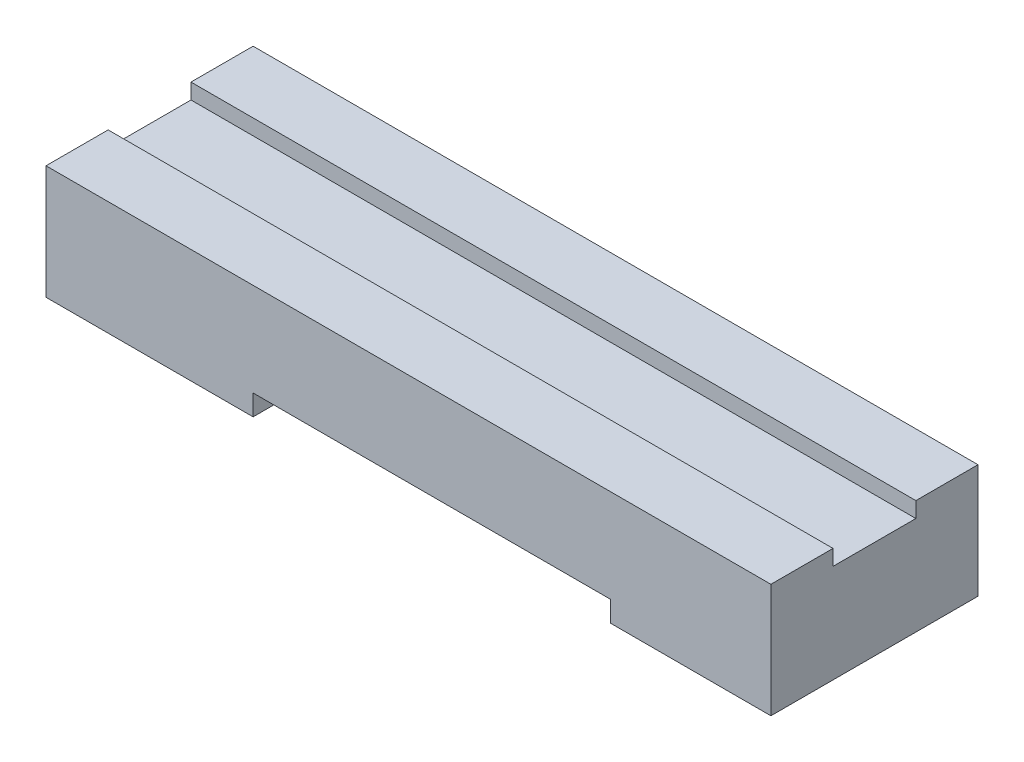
ISO-10303-21;
HEADER;
FILE_DESCRIPTION(('STEP AP214'),'2;1');
FILE_NAME('part.step','',(''),(''),'','','');
FILE_SCHEMA(('AUTOMOTIVE_DESIGN { 1 0 10303 214 1 1 1 1 }'));
ENDSEC;
DATA;
#1=APPLICATION_CONTEXT('core data for automotive mechanical design processes');
#2=APPLICATION_PROTOCOL_DEFINITION('international standard','automotive_design',2000,#1);
#3=PRODUCT_CONTEXT('',#1,'mechanical');
#4=PRODUCT('Part','Part','',(#3));
#5=PRODUCT_RELATED_PRODUCT_CATEGORY('part','',(#4));
#6=PRODUCT_DEFINITION_FORMATION('','',#4);
#7=PRODUCT_DEFINITION_CONTEXT('part definition',#1,'design');
#8=PRODUCT_DEFINITION('design','',#6,#7);
#9=PRODUCT_DEFINITION_SHAPE('','',#8);
#10=(LENGTH_UNIT() NAMED_UNIT(*) SI_UNIT(.MILLI.,.METRE.));
#11=(NAMED_UNIT(*) PLANE_ANGLE_UNIT() SI_UNIT($,.RADIAN.));
#12=(NAMED_UNIT(*) SI_UNIT($,.STERADIAN.) SOLID_ANGLE_UNIT());
#13=UNCERTAINTY_MEASURE_WITH_UNIT(LENGTH_MEASURE(1.E-05),#10,'distance_accuracy_value','');
#14=(GEOMETRIC_REPRESENTATION_CONTEXT(3) GLOBAL_UNCERTAINTY_ASSIGNED_CONTEXT((#13)) GLOBAL_UNIT_ASSIGNED_CONTEXT((#10,
#11,#12)) REPRESENTATION_CONTEXT('',''));
#15=CARTESIAN_POINT('',(0.,0.,0.));
#16=DIRECTION('',(0.,0.,1.));
#17=DIRECTION('',(1.,0.,0.));
#18=AXIS2_PLACEMENT_3D('',#15,#16,#17);
#19=CARTESIAN_POINT('',(-700.,110.,400.));
#20=DIRECTION('',(0.,-1.,0.));
#21=DIRECTION('',(0.,0.,-1.));
#22=AXIS2_PLACEMENT_3D('',#19,#20,#21);
#23=PLANE('',#22);
#24=DIRECTION('',(0.,0.,-1.));
#25=VECTOR('',#24,1.);
#26=CARTESIAN_POINT('',(-700.,110.,400.));
#27=LINE('',#26,#25);
#28=CARTESIAN_POINT('',(-700.,110.,120.));
#29=VERTEX_POINT('',#28);
#30=CARTESIAN_POINT('',(-700.,110.,0.));
#31=VERTEX_POINT('',#30);
#32=EDGE_CURVE('E199',#29,#31,#27,.T.);
#33=ORIENTED_EDGE('',*,*,#32,.F.);
#34=DIRECTION('',(-1.,0.,0.));
#35=VECTOR('',#34,1.);
#36=CARTESIAN_POINT('',(700.,110.,120.));
#37=LINE('',#36,#35);
#38=CARTESIAN_POINT('',(700.,110.,120.));
#39=VERTEX_POINT('',#38);
#40=EDGE_CURVE('E134',#39,#29,#37,.T.);
#41=ORIENTED_EDGE('',*,*,#40,.F.);
#42=DIRECTION('',(0.,0.,-1.));
#43=VECTOR('',#42,1.);
#44=CARTESIAN_POINT('',(700.,110.,400.));
#45=LINE('',#44,#43);
#46=CARTESIAN_POINT('',(700.,110.,0.));
#47=VERTEX_POINT('',#46);
#48=EDGE_CURVE('E202',#39,#47,#45,.T.);
#49=ORIENTED_EDGE('',*,*,#48,.T.);
#50=DIRECTION('',(-1.,0.,0.));
#51=VECTOR('',#50,1.);
#52=CARTESIAN_POINT('',(-700.,110.,0.));
#53=LINE('',#52,#51);
#54=EDGE_CURVE('E185',#47,#31,#53,.T.);
#55=ORIENTED_EDGE('',*,*,#54,.T.);
#56=EDGE_LOOP('',(#33,#41,#49,#55));
#57=FACE_BOUND('',#56,.T.);
#58=ADVANCED_FACE('F29',(#57),#23,.F.);
#59=CARTESIAN_POINT('',(-700.,-110.,400.));
#60=DIRECTION('',(0.,1.,0.));
#61=DIRECTION('',(-1.,0.,0.));
#62=AXIS2_PLACEMENT_3D('',#59,#60,#61);
#63=PLANE('',#62);
#64=DIRECTION('',(1.,0.,0.));
#65=VECTOR('',#64,1.);
#66=CARTESIAN_POINT('',(-700.,-110.,0.));
#67=LINE('',#66,#65);
#68=CARTESIAN_POINT('',(-700.,-110.,0.));
#69=VERTEX_POINT('',#68);
#70=CARTESIAN_POINT('',(-300.,-110.,0.));
#71=VERTEX_POINT('',#70);
#72=EDGE_CURVE('E179',#69,#71,#67,.T.);
#73=ORIENTED_EDGE('',*,*,#72,.T.);
#74=DIRECTION('',(0.,0.,1.));
#75=VECTOR('',#74,1.);
#76=CARTESIAN_POINT('',(-300.,-110.,0.));
#77=LINE('',#76,#75);
#78=CARTESIAN_POINT('',(-300.,-110.,400.));
#79=VERTEX_POINT('',#78);
#80=EDGE_CURVE('E166',#71,#79,#77,.T.);
#81=ORIENTED_EDGE('',*,*,#80,.T.);
#82=DIRECTION('',(1.,0.,0.));
#83=VECTOR('',#82,1.);
#84=CARTESIAN_POINT('',(-700.,-110.,400.));
#85=LINE('',#84,#83);
#86=CARTESIAN_POINT('',(-700.,-110.,400.));
#87=VERTEX_POINT('',#86);
#88=EDGE_CURVE('E192',#87,#79,#85,.T.);
#89=ORIENTED_EDGE('',*,*,#88,.F.);
#90=DIRECTION('',(0.,0.,-1.));
#91=VECTOR('',#90,1.);
#92=CARTESIAN_POINT('',(-700.,-110.,400.));
#93=LINE('',#92,#91);
#94=EDGE_CURVE('E11',#87,#69,#93,.T.);
#95=ORIENTED_EDGE('',*,*,#94,.T.);
#96=EDGE_LOOP('',(#73,#81,#89,#95));
#97=FACE_BOUND('',#96,.T.);
#98=ADVANCED_FACE('F240',(#97),#63,.F.);
#99=CARTESIAN_POINT('',(-700.,110.,400.));
#100=DIRECTION('',(1.,0.,0.));
#101=DIRECTION('',(0.,0.,-1.));
#102=AXIS2_PLACEMENT_3D('',#99,#100,#101);
#103=PLANE('',#102);
#104=DIRECTION('',(0.,0.,1.));
#105=VECTOR('',#104,1.);
#106=CARTESIAN_POINT('',(-700.,80.,120.));
#107=LINE('',#106,#105);
#108=CARTESIAN_POINT('',(-700.,80.,120.));
#109=VERTEX_POINT('',#108);
#110=CARTESIAN_POINT('',(-700.,80.,280.));
#111=VERTEX_POINT('',#110);
#112=EDGE_CURVE('E122',#109,#111,#107,.T.);
#113=ORIENTED_EDGE('',*,*,#112,.F.);
#114=DIRECTION('',(0.,-1.,0.));
#115=VECTOR('',#114,1.);
#116=CARTESIAN_POINT('',(-700.,110.,120.));
#117=LINE('',#116,#115);
#118=EDGE_CURVE('E131',#29,#109,#117,.T.);
#119=ORIENTED_EDGE('',*,*,#118,.F.);
#120=ORIENTED_EDGE('',*,*,#32,.T.);
#121=DIRECTION('',(0.,-1.,0.));
#122=VECTOR('',#121,1.);
#123=CARTESIAN_POINT('',(-700.,110.,0.));
#124=LINE('',#123,#122);
#125=EDGE_CURVE('E169',#31,#69,#124,.T.);
#126=ORIENTED_EDGE('',*,*,#125,.T.);
#127=ORIENTED_EDGE('',*,*,#94,.F.);
#128=DIRECTION('',(0.,-1.,0.));
#129=VECTOR('',#128,1.);
#130=CARTESIAN_POINT('',(-700.,110.,400.));
#131=LINE('',#130,#129);
#132=CARTESIAN_POINT('',(-700.,110.,400.));
#133=VERTEX_POINT('',#132);
#134=EDGE_CURVE('E188',#133,#87,#131,.T.);
#135=ORIENTED_EDGE('',*,*,#134,.F.);
#136=CARTESIAN_POINT('',(-700.,110.,280.));
#137=VERTEX_POINT('',#136);
#138=EDGE_CURVE('E200',#133,#137,#27,.T.);
#139=ORIENTED_EDGE('',*,*,#138,.T.);
#140=DIRECTION('',(0.,1.,0.));
#141=VECTOR('',#140,1.);
#142=CARTESIAN_POINT('',(-700.,110.,280.));
#143=LINE('',#142,#141);
#144=EDGE_CURVE('E44',#111,#137,#143,.T.);
#145=ORIENTED_EDGE('',*,*,#144,.F.);
#146=EDGE_LOOP('',(#113,#119,#120,#126,#127,#135,#139,#145));
#147=FACE_BOUND('',#146,.T.);
#148=ADVANCED_FACE('F31',(#147),#103,.F.);
#149=CARTESIAN_POINT('',(390.,-110.,400.));
#150=VERTEX_POINT('',#149);
#151=CARTESIAN_POINT('',(700.,-110.,400.));
#152=VERTEX_POINT('',#151);
#153=EDGE_CURVE('E191',#150,#152,#85,.T.);
#154=ORIENTED_EDGE('',*,*,#153,.F.);
#155=DIRECTION('',(0.,0.,1.));
#156=VECTOR('',#155,1.);
#157=CARTESIAN_POINT('',(390.,-110.,0.));
#158=LINE('',#157,#156);
#159=CARTESIAN_POINT('',(390.,-110.,0.));
#160=VERTEX_POINT('',#159);
#161=EDGE_CURVE('E172',#160,#150,#158,.T.);
#162=ORIENTED_EDGE('',*,*,#161,.F.);
#163=CARTESIAN_POINT('',(700.,-110.,0.));
#164=VERTEX_POINT('',#163);
#165=EDGE_CURVE('E178',#160,#164,#67,.T.);
#166=ORIENTED_EDGE('',*,*,#165,.T.);
#167=DIRECTION('',(0.,0.,-1.));
#168=VECTOR('',#167,1.);
#169=CARTESIAN_POINT('',(700.,-110.,400.));
#170=LINE('',#169,#168);
#171=EDGE_CURVE('E37',#152,#164,#170,.T.);
#172=ORIENTED_EDGE('',*,*,#171,.F.);
#173=EDGE_LOOP('',(#154,#162,#166,#172));
#174=FACE_BOUND('',#173,.T.);
#175=ADVANCED_FACE('F234',(#174),#63,.F.);
#176=CARTESIAN_POINT('',(700.,110.,400.));
#177=DIRECTION('',(-1.,0.,0.));
#178=DIRECTION('',(0.,-1.,0.));
#179=AXIS2_PLACEMENT_3D('',#176,#177,#178);
#180=PLANE('',#179);
#181=ORIENTED_EDGE('',*,*,#48,.F.);
#182=DIRECTION('',(0.,-1.,0.));
#183=VECTOR('',#182,1.);
#184=CARTESIAN_POINT('',(700.,110.,120.));
#185=LINE('',#184,#183);
#186=CARTESIAN_POINT('',(700.,80.,120.));
#187=VERTEX_POINT('',#186);
#188=EDGE_CURVE('E140',#39,#187,#185,.T.);
#189=ORIENTED_EDGE('',*,*,#188,.T.);
#190=DIRECTION('',(0.,0.,1.));
#191=VECTOR('',#190,1.);
#192=CARTESIAN_POINT('',(700.,80.,120.));
#193=LINE('',#192,#191);
#194=CARTESIAN_POINT('',(700.,80.,280.));
#195=VERTEX_POINT('',#194);
#196=EDGE_CURVE('E124',#187,#195,#193,.T.);
#197=ORIENTED_EDGE('',*,*,#196,.T.);
#198=DIRECTION('',(0.,1.,0.));
#199=VECTOR('',#198,1.);
#200=CARTESIAN_POINT('',(700.,110.,280.));
#201=LINE('',#200,#199);
#202=CARTESIAN_POINT('',(700.,110.,280.));
#203=VERTEX_POINT('',#202);
#204=EDGE_CURVE('E128',#195,#203,#201,.T.);
#205=ORIENTED_EDGE('',*,*,#204,.T.);
#206=CARTESIAN_POINT('',(700.,110.,400.));
#207=VERTEX_POINT('',#206);
#208=EDGE_CURVE('E203',#207,#203,#45,.T.);
#209=ORIENTED_EDGE('',*,*,#208,.F.);
#210=DIRECTION('',(0.,1.,0.));
#211=VECTOR('',#210,1.);
#212=CARTESIAN_POINT('',(700.,110.,400.));
#213=LINE('',#212,#211);
#214=EDGE_CURVE('E195',#152,#207,#213,.T.);
#215=ORIENTED_EDGE('',*,*,#214,.F.);
#216=ORIENTED_EDGE('',*,*,#171,.T.);
#217=DIRECTION('',(0.,1.,0.));
#218=VECTOR('',#217,1.);
#219=CARTESIAN_POINT('',(700.,110.,0.));
#220=LINE('',#219,#218);
#221=EDGE_CURVE('E182',#164,#47,#220,.T.);
#222=ORIENTED_EDGE('',*,*,#221,.T.);
#223=EDGE_LOOP('',(#181,#189,#197,#205,#209,#215,#216,#222));
#224=FACE_BOUND('',#223,.T.);
#225=ADVANCED_FACE('F211',(#224),#180,.F.);
#226=ORIENTED_EDGE('',*,*,#208,.T.);
#227=DIRECTION('',(-1.,0.,0.));
#228=VECTOR('',#227,1.);
#229=CARTESIAN_POINT('',(700.,110.,280.));
#230=LINE('',#229,#228);
#231=EDGE_CURVE('E149',#203,#137,#230,.T.);
#232=ORIENTED_EDGE('',*,*,#231,.T.);
#233=ORIENTED_EDGE('',*,*,#138,.F.);
#234=DIRECTION('',(-1.,0.,0.));
#235=VECTOR('',#234,1.);
#236=CARTESIAN_POINT('',(-700.,110.,400.));
#237=LINE('',#236,#235);
#238=EDGE_CURVE('E197',#207,#133,#237,.T.);
#239=ORIENTED_EDGE('',*,*,#238,.F.);
#240=EDGE_LOOP('',(#226,#232,#233,#239));
#241=FACE_BOUND('',#240,.T.);
#242=ADVANCED_FACE('F224',(#241),#23,.F.);
#243=CARTESIAN_POINT('',(-700.,110.,400.));
#244=DIRECTION('',(0.,0.,1.));
#245=DIRECTION('',(1.,0.,0.));
#246=AXIS2_PLACEMENT_3D('',#243,#244,#245);
#247=PLANE('',#246);
#248=DIRECTION('',(0.,-1.,0.));
#249=VECTOR('',#248,1.);
#250=CARTESIAN_POINT('',(-300.,-70.,400.));
#251=LINE('',#250,#249);
#252=CARTESIAN_POINT('',(-300.,-70.,400.));
#253=VERTEX_POINT('',#252);
#254=EDGE_CURVE('E148',#253,#79,#251,.T.);
#255=ORIENTED_EDGE('',*,*,#254,.F.);
#256=DIRECTION('',(-1.,0.,0.));
#257=VECTOR('',#256,1.);
#258=CARTESIAN_POINT('',(-300.,-70.,400.));
#259=LINE('',#258,#257);
#260=CARTESIAN_POINT('',(390.,-70.,400.));
#261=VERTEX_POINT('',#260);
#262=EDGE_CURVE('E156',#261,#253,#259,.T.);
#263=ORIENTED_EDGE('',*,*,#262,.F.);
#264=DIRECTION('',(0.,1.,0.));
#265=VECTOR('',#264,1.);
#266=CARTESIAN_POINT('',(390.,-70.,400.));
#267=LINE('',#266,#265);
#268=EDGE_CURVE('E153',#150,#261,#267,.T.);
#269=ORIENTED_EDGE('',*,*,#268,.F.);
#270=ORIENTED_EDGE('',*,*,#153,.T.);
#271=ORIENTED_EDGE('',*,*,#214,.T.);
#272=ORIENTED_EDGE('',*,*,#238,.T.);
#273=ORIENTED_EDGE('',*,*,#134,.T.);
#274=ORIENTED_EDGE('',*,*,#88,.T.);
#275=EDGE_LOOP('',(#255,#263,#269,#270,#271,#272,#273,#274));
#276=FACE_BOUND('',#275,.T.);
#277=ADVANCED_FACE('F229',(#276),#247,.T.);
#278=CARTESIAN_POINT('',(-700.,110.,0.));
#279=DIRECTION('',(0.,0.,1.));
#280=DIRECTION('',(1.,0.,0.));
#281=AXIS2_PLACEMENT_3D('',#278,#279,#280);
#282=PLANE('',#281);
#283=DIRECTION('',(-1.,0.,0.));
#284=VECTOR('',#283,1.);
#285=CARTESIAN_POINT('',(-300.,-70.,0.));
#286=LINE('',#285,#284);
#287=CARTESIAN_POINT('',(390.,-70.,0.));
#288=VERTEX_POINT('',#287);
#289=CARTESIAN_POINT('',(-300.,-70.,0.));
#290=VERTEX_POINT('',#289);
#291=EDGE_CURVE('E52',#288,#290,#286,.T.);
#292=ORIENTED_EDGE('',*,*,#291,.T.);
#293=DIRECTION('',(0.,-1.,0.));
#294=VECTOR('',#293,1.);
#295=CARTESIAN_POINT('',(-300.,-70.,0.));
#296=LINE('',#295,#294);
#297=EDGE_CURVE('E159',#290,#71,#296,.T.);
#298=ORIENTED_EDGE('',*,*,#297,.T.);
#299=ORIENTED_EDGE('',*,*,#72,.F.);
#300=ORIENTED_EDGE('',*,*,#125,.F.);
#301=ORIENTED_EDGE('',*,*,#54,.F.);
#302=ORIENTED_EDGE('',*,*,#221,.F.);
#303=ORIENTED_EDGE('',*,*,#165,.F.);
#304=DIRECTION('',(0.,1.,0.));
#305=VECTOR('',#304,1.);
#306=CARTESIAN_POINT('',(390.,-70.,0.));
#307=LINE('',#306,#305);
#308=EDGE_CURVE('E162',#160,#288,#307,.T.);
#309=ORIENTED_EDGE('',*,*,#308,.T.);
#310=EDGE_LOOP('',(#292,#298,#299,#300,#301,#302,#303,#309));
#311=FACE_BOUND('',#310,.T.);
#312=ADVANCED_FACE('F218',(#311),#282,.F.);
#313=CARTESIAN_POINT('',(-300.,-70.,0.));
#314=DIRECTION('',(-1.,0.,0.));
#315=DIRECTION('',(0.,0.,1.));
#316=AXIS2_PLACEMENT_3D('',#313,#314,#315);
#317=PLANE('',#316);
#318=ORIENTED_EDGE('',*,*,#254,.T.);
#319=ORIENTED_EDGE('',*,*,#80,.F.);
#320=ORIENTED_EDGE('',*,*,#297,.F.);
#321=DIRECTION('',(0.,0.,1.));
#322=VECTOR('',#321,1.);
#323=CARTESIAN_POINT('',(-300.,-70.,0.));
#324=LINE('',#323,#322);
#325=EDGE_CURVE('E167',#290,#253,#324,.T.);
#326=ORIENTED_EDGE('',*,*,#325,.T.);
#327=EDGE_LOOP('',(#318,#319,#320,#326));
#328=FACE_BOUND('',#327,.T.);
#329=ADVANCED_FACE('F241',(#328),#317,.F.);
#330=CARTESIAN_POINT('',(-300.,-70.,0.));
#331=DIRECTION('',(0.,1.,0.));
#332=DIRECTION('',(0.,0.,1.));
#333=AXIS2_PLACEMENT_3D('',#330,#331,#332);
#334=PLANE('',#333);
#335=ORIENTED_EDGE('',*,*,#262,.T.);
#336=ORIENTED_EDGE('',*,*,#325,.F.);
#337=ORIENTED_EDGE('',*,*,#291,.F.);
#338=DIRECTION('',(0.,0.,1.));
#339=VECTOR('',#338,1.);
#340=CARTESIAN_POINT('',(390.,-70.,0.));
#341=LINE('',#340,#339);
#342=EDGE_CURVE('E170',#288,#261,#341,.T.);
#343=ORIENTED_EDGE('',*,*,#342,.T.);
#344=EDGE_LOOP('',(#335,#336,#337,#343));
#345=FACE_BOUND('',#344,.T.);
#346=ADVANCED_FACE('F242',(#345),#334,.F.);
#347=CARTESIAN_POINT('',(390.,-70.,0.));
#348=DIRECTION('',(1.,0.,0.));
#349=DIRECTION('',(0.,1.,0.));
#350=AXIS2_PLACEMENT_3D('',#347,#348,#349);
#351=PLANE('',#350);
#352=ORIENTED_EDGE('',*,*,#268,.T.);
#353=ORIENTED_EDGE('',*,*,#342,.F.);
#354=ORIENTED_EDGE('',*,*,#308,.F.);
#355=ORIENTED_EDGE('',*,*,#161,.T.);
#356=EDGE_LOOP('',(#352,#353,#354,#355));
#357=FACE_BOUND('',#356,.T.);
#358=ADVANCED_FACE('F236',(#357),#351,.F.);
#359=CARTESIAN_POINT('',(700.,110.,120.));
#360=DIRECTION('',(0.,0.,-1.));
#361=DIRECTION('',(-1.,0.,0.));
#362=AXIS2_PLACEMENT_3D('',#359,#360,#361);
#363=PLANE('',#362);
#364=ORIENTED_EDGE('',*,*,#118,.T.);
#365=DIRECTION('',(-1.,0.,0.));
#366=VECTOR('',#365,1.);
#367=CARTESIAN_POINT('',(700.,80.,120.));
#368=LINE('',#367,#366);
#369=EDGE_CURVE('E118',#187,#109,#368,.T.);
#370=ORIENTED_EDGE('',*,*,#369,.F.);
#371=ORIENTED_EDGE('',*,*,#188,.F.);
#372=ORIENTED_EDGE('',*,*,#40,.T.);
#373=EDGE_LOOP('',(#364,#370,#371,#372));
#374=FACE_BOUND('',#373,.T.);
#375=ADVANCED_FACE('F132',(#374),#363,.F.);
#376=CARTESIAN_POINT('',(700.,110.,280.));
#377=DIRECTION('',(0.,0.,1.));
#378=DIRECTION('',(1.,0.,0.));
#379=AXIS2_PLACEMENT_3D('',#376,#377,#378);
#380=PLANE('',#379);
#381=ORIENTED_EDGE('',*,*,#144,.T.);
#382=ORIENTED_EDGE('',*,*,#231,.F.);
#383=ORIENTED_EDGE('',*,*,#204,.F.);
#384=DIRECTION('',(-1.,0.,0.));
#385=VECTOR('',#384,1.);
#386=CARTESIAN_POINT('',(700.,80.,280.));
#387=LINE('',#386,#385);
#388=EDGE_CURVE('E127',#195,#111,#387,.T.);
#389=ORIENTED_EDGE('',*,*,#388,.T.);
#390=EDGE_LOOP('',(#381,#382,#383,#389));
#391=FACE_BOUND('',#390,.T.);
#392=ADVANCED_FACE('F326',(#391),#380,.F.);
#393=CARTESIAN_POINT('',(700.,80.,120.));
#394=DIRECTION('',(0.,-1.,0.));
#395=DIRECTION('',(0.,0.,-1.));
#396=AXIS2_PLACEMENT_3D('',#393,#394,#395);
#397=PLANE('',#396);
#398=ORIENTED_EDGE('',*,*,#112,.T.);
#399=ORIENTED_EDGE('',*,*,#388,.F.);
#400=ORIENTED_EDGE('',*,*,#196,.F.);
#401=ORIENTED_EDGE('',*,*,#369,.T.);
#402=EDGE_LOOP('',(#398,#399,#400,#401));
#403=FACE_BOUND('',#402,.T.);
#404=ADVANCED_FACE('F120',(#403),#397,.F.);
#405=CLOSED_SHELL('',(#58,#98,#148,#175,#225,#242,#277,#312,#329,#346,#358,#375,#392,#404));
#406=MANIFOLD_SOLID_BREP('B2',#405);
#407=ADVANCED_BREP_SHAPE_REPRESENTATION('',(#18,#406),#14);
#408=SHAPE_DEFINITION_REPRESENTATION(#9,#407);
ENDSEC;
END-ISO-10303-21;
